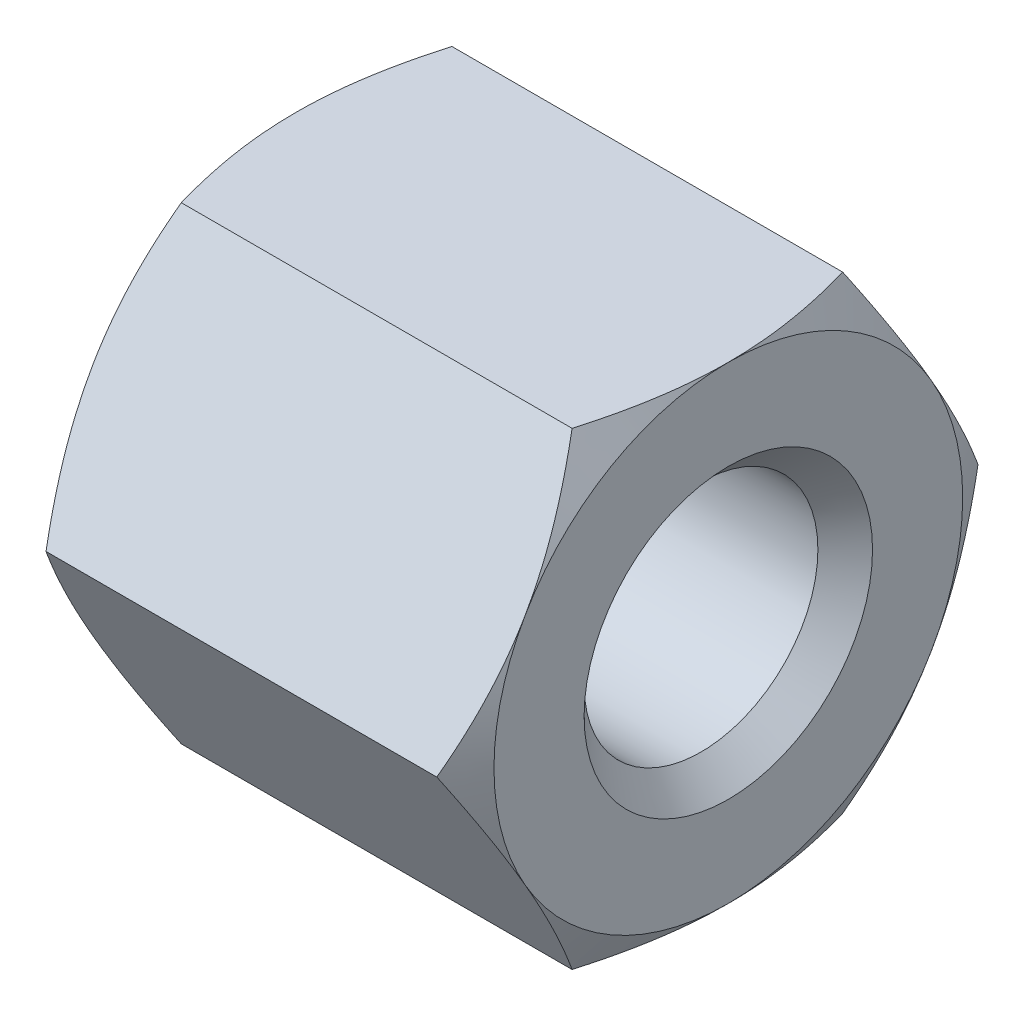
ISO-10303-21;
HEADER;
FILE_DESCRIPTION(('STEP AP214'),'2;1');
FILE_NAME('part.step','',(''),(''),'','','');
FILE_SCHEMA(('AUTOMOTIVE_DESIGN { 1 0 10303 214 1 1 1 1 }'));
ENDSEC;
DATA;
#1=APPLICATION_CONTEXT('core data for automotive mechanical design processes');
#2=APPLICATION_PROTOCOL_DEFINITION('international standard','automotive_design',2000,#1);
#3=PRODUCT_CONTEXT('',#1,'mechanical');
#4=PRODUCT('Part','Part','',(#3));
#5=PRODUCT_RELATED_PRODUCT_CATEGORY('part','',(#4));
#6=PRODUCT_DEFINITION_FORMATION('','',#4);
#7=PRODUCT_DEFINITION_CONTEXT('part definition',#1,'design');
#8=PRODUCT_DEFINITION('design','',#6,#7);
#9=PRODUCT_DEFINITION_SHAPE('','',#8);
#10=(LENGTH_UNIT() NAMED_UNIT(*) SI_UNIT(.MILLI.,.METRE.));
#11=(NAMED_UNIT(*) PLANE_ANGLE_UNIT() SI_UNIT($,.RADIAN.));
#12=(NAMED_UNIT(*) SI_UNIT($,.STERADIAN.) SOLID_ANGLE_UNIT());
#13=UNCERTAINTY_MEASURE_WITH_UNIT(LENGTH_MEASURE(1.E-05),#10,'distance_accuracy_value','');
#14=(GEOMETRIC_REPRESENTATION_CONTEXT(3) GLOBAL_UNCERTAINTY_ASSIGNED_CONTEXT((#13)) GLOBAL_UNIT_ASSIGNED_CONTEXT((#10,
#11,#12)) REPRESENTATION_CONTEXT('',''));
#15=CARTESIAN_POINT('',(0.,0.,0.));
#16=DIRECTION('',(0.,0.,1.));
#17=DIRECTION('',(1.,0.,0.));
#18=AXIS2_PLACEMENT_3D('',#15,#16,#17);
#19=CARTESIAN_POINT('',(60.,-32.5,18.7638837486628));
#20=DIRECTION('',(0.,-0.5,0.866025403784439));
#21=DIRECTION('',(-1.,0.,0.));
#22=AXIS2_PLACEMENT_3D('',#19,#20,#21);
#23=PLANE('',#22);
#24=DIRECTION('',(-1.,0.,0.));
#25=VECTOR('',#24,1.);
#26=CARTESIAN_POINT('',(60.,0.,37.5277674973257));
#27=LINE('',#26,#25);
#28=CARTESIAN_POINT('',(57.0972170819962,0.,37.5277674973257));
#29=VERTEX_POINT('',#28);
#30=CARTESIAN_POINT('',(2.90278291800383,0.,37.5277674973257));
#31=VERTEX_POINT('',#30);
#32=EDGE_CURVE('E10',#29,#31,#27,.T.);
#33=ORIENTED_EDGE('',*,*,#32,.T.);
#34=CARTESIAN_POINT('',(0.,-16.25,28.1458256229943));
#35=CARTESIAN_POINT('',(-6.06957400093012E-05,-15.7921171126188,28.4101173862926));
#36=CARTESIAN_POINT('',(0.00742678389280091,-15.3342791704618,28.6744766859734));
#37=CARTESIAN_POINT('',(0.0372859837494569,-14.4185562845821,29.2033480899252));
#38=CARTESIAN_POINT('',(0.0596727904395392,-13.9606717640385,29.4678600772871));
#39=CARTESIAN_POINT('',(0.119310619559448,-13.0426800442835,29.9982327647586));
#40=CARTESIAN_POINT('',(0.156657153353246,-12.5825777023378,30.2640910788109));
#41=CARTESIAN_POINT('',(0.245063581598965,-11.6690218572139,30.7916064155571));
#42=CARTESIAN_POINT('',(0.295945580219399,-11.2155573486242,31.0532743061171));
#43=CARTESIAN_POINT('',(0.411580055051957,-10.3080008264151,31.576984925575));
#44=CARTESIAN_POINT('',(0.476390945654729,-9.8539144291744,31.8390244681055));
#45=CARTESIAN_POINT('',(0.619817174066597,-8.94336836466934,32.3645319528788));
#46=CARTESIAN_POINT('',(0.698548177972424,-8.48692262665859,32.6279923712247));
#47=CARTESIAN_POINT('',(0.865474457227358,-7.59272925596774,33.1439569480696));
#48=CARTESIAN_POINT('',(0.95320714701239,-7.15491926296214,33.3965032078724));
#49=CARTESIAN_POINT('',(1.14062776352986,-6.27739603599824,33.9027319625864));
#50=CARTESIAN_POINT('',(1.24041091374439,-5.83769822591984,34.1564058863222));
#51=CARTESIAN_POINT('',(1.45190488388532,-4.95526511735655,34.6656637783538));
#52=CARTESIAN_POINT('',(1.56373950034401,-4.51255290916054,34.921236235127));
#53=CARTESIAN_POINT('',(1.79930885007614,-3.6229858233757,35.4349256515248));
#54=CARTESIAN_POINT('',(1.92318952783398,-3.17616091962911,35.6930274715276));
#55=CARTESIAN_POINT('',(2.18282957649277,-2.27732064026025,36.2123002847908));
#56=CARTESIAN_POINT('',(2.31875096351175,-1.82534095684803,36.4734518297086));
#57=CARTESIAN_POINT('',(2.60246507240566,-0.91519469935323,36.9992515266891));
#58=CARTESIAN_POINT('',(2.75043055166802,-0.457067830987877,37.263875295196));
#59=CARTESIAN_POINT('',(2.90278291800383,0.,37.5277674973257));
#60=B_SPLINE_CURVE_WITH_KNOTS('',3,(#34,#35,#36,#37,#38,#39,#40,#41,#42,#43,#44,#45,#46,#47,#48,
#49,#50,#51,#52,#53,#54,#55,#56,#57,#58,#59),.UNSPECIFIED.,.F.,.F.,(4,2,2,2,2,2,2,2,2,2,2,2,4),
(0.,1.58599003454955,3.17358842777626,4.77148875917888,6.349345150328,7.93395251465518,
9.53240509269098,11.0712322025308,12.6231309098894,14.192848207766,15.7847679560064,
17.4029021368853,19.0508907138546),.UNSPECIFIED.);
#61=CARTESIAN_POINT('',(0.,-16.25,28.1458256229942));
#62=VERTEX_POINT('',#61);
#63=EDGE_CURVE('E752',#62,#31,#60,.T.);
#64=ORIENTED_EDGE('',*,*,#63,.F.);
#65=CARTESIAN_POINT('',(2.9027829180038,-32.4999999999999,18.7638837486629));
#66=CARTESIAN_POINT('',(2.67537951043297,-31.8177785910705,19.1577107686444));
#67=CARTESIAN_POINT('',(2.45782768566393,-31.1330205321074,19.5529947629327));
#68=CARTESIAN_POINT('',(2.0502581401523,-29.775442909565,20.336831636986));
#69=CARTESIAN_POINT('',(1.85969459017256,-29.1027442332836,20.7253107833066));
#70=CARTESIAN_POINT('',(1.50601602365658,-27.7660418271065,21.4975626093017));
#71=CARTESIAN_POINT('',(1.34243315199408,-27.1021288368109,21.8812766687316));
#72=CARTESIAN_POINT('',(1.04273374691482,-25.7792636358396,22.6460793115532));
#73=CARTESIAN_POINT('',(0.906269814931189,-25.1203691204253,23.0271312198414));
#74=CARTESIAN_POINT('',(0.653965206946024,-23.7688684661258,23.807250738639));
#75=CARTESIAN_POINT('',(0.539311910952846,-23.0760664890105,24.2063657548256));
#76=CARTESIAN_POINT('',(0.343294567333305,-21.7002606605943,24.9988294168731));
#77=CARTESIAN_POINT('',(0.261337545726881,-21.0173218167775,25.3921429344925));
#78=CARTESIAN_POINT('',(0.130641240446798,-19.6553249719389,26.1777837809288));
#79=CARTESIAN_POINT('',(0.081630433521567,-18.9762821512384,26.5700919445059));
#80=CARTESIAN_POINT('',(0.0161173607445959,-17.6148745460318,27.3569466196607));
#81=CARTESIAN_POINT('',(-0.000275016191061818,-16.9325062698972,27.7514962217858));
#82=CARTESIAN_POINT('',(0.,-16.25,28.1458256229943));
#83=B_SPLINE_CURVE_WITH_KNOTS('',3,(#65,#66,#67,#68,#69,#70,#71,#72,#73,#74,#75,#76,#77,#78,#79,
#80,#81,#82),.UNSPECIFIED.,.F.,.F.,(4,2,2,2,2,2,2,2,4),(0.,2.45975370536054,4.8589764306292,
7.21080507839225,9.53022809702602,11.9528238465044,14.3292338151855,16.6858105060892,
19.0503129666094),.UNSPECIFIED.);
#84=CARTESIAN_POINT('',(2.90278291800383,-32.5,18.7638837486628));
#85=VERTEX_POINT('',#84);
#86=EDGE_CURVE('E748',#85,#62,#83,.T.);
#87=ORIENTED_EDGE('',*,*,#86,.F.);
#88=DIRECTION('',(-1.,0.,0.));
#89=VECTOR('',#88,1.);
#90=CARTESIAN_POINT('',(60.,-32.5,18.7638837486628));
#91=LINE('',#90,#89);
#92=CARTESIAN_POINT('',(57.0972170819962,-32.5,18.7638837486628));
#93=VERTEX_POINT('',#92);
#94=EDGE_CURVE('E298',#93,#85,#91,.T.);
#95=ORIENTED_EDGE('',*,*,#94,.F.);
#96=CARTESIAN_POINT('',(60.,-16.25,28.1458256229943));
#97=CARTESIAN_POINT('',(60.0000606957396,-16.7078248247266,27.881433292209));
#98=CARTESIAN_POINT('',(59.9925732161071,-17.1656856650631,27.6171136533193));
#99=CARTESIAN_POINT('',(59.9627140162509,-18.0815631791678,27.0885100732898));
#100=CARTESIAN_POINT('',(59.9403272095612,-18.5395795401,26.8242264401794));
#101=CARTESIAN_POINT('',(59.8806893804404,-19.4578916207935,26.2944086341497));
#102=CARTESIAN_POINT('',(59.8433428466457,-19.9181828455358,26.0288774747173));
#103=CARTESIAN_POINT('',(59.754936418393,-20.8318024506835,25.5014725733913));
#104=CARTESIAN_POINT('',(59.7040544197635,-21.2851457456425,25.2395947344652));
#105=CARTESIAN_POINT('',(59.5884199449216,-22.1924707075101,24.7154830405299));
#106=CARTESIAN_POINT('',(59.523609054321,-22.6464468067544,24.4532524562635));
#107=CARTESIAN_POINT('',(59.3801828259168,-23.5568226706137,23.9274501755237));
#108=CARTESIAN_POINT('',(59.301451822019,-24.0132089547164,23.6638867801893));
#109=CARTESIAN_POINT('',(59.1345255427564,-24.9071440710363,23.1474748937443));
#110=CARTESIAN_POINT('',(59.0467928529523,-25.3447605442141,22.8945934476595));
#111=CARTESIAN_POINT('',(58.8593722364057,-26.2219291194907,22.3877504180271));
#112=CARTESIAN_POINT('',(58.7595890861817,-26.6614660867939,22.1337979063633));
#113=CARTESIAN_POINT('',(58.5480951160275,-27.5437129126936,21.6242173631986));
#114=CARTESIAN_POINT('',(58.4362604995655,-27.9864012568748,21.368603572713));
#115=CARTESIAN_POINT('',(58.2006911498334,-28.8760528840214,20.8550605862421));
#116=CARTESIAN_POINT('',(58.0768104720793,-29.3229880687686,20.5971497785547));
#117=CARTESIAN_POINT('',(57.8171704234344,-30.2221116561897,20.0783676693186));
#118=CARTESIAN_POINT('',(57.6812490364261,-30.6742653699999,19.8175175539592));
#119=CARTESIAN_POINT('',(57.3975349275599,-31.5846943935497,19.2922076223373));
#120=CARTESIAN_POINT('',(57.2495694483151,-32.0429287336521,19.0277700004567));
#121=CARTESIAN_POINT('',(57.0972170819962,-32.5,18.7638837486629));
#122=B_SPLINE_CURVE_WITH_KNOTS('',3,(#96,#97,#98,#99,#100,#101,#102,#103,#104,#105,#106,#107,
#108,#109,#110,#111,#112,#113,#114,#115,#116,#117,#118,#119,#120,#121),.UNSPECIFIED.,.F.,.F.,(4,
2,2,2,2,2,2,2,2,2,2,2,4),(0.,1.58599003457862,3.17358842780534,4.77148875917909,6.3493451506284,
7.93395251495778,9.53240509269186,11.0712322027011,12.6231309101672,14.1928482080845,
15.7847679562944,17.4029021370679,19.0508907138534),.UNSPECIFIED.);
#123=CARTESIAN_POINT('',(60.,-16.25,28.1458256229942));
#124=VERTEX_POINT('',#123);
#125=EDGE_CURVE('E284',#124,#93,#122,.T.);
#126=ORIENTED_EDGE('',*,*,#125,.F.);
#127=CARTESIAN_POINT('',(57.0972170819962,1.57465114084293E-13,37.5277674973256));
#128=CARTESIAN_POINT('',(57.3246204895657,-0.682174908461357,37.1338599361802));
#129=CARTESIAN_POINT('',(57.5421723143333,-1.36687991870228,36.7384840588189));
#130=CARTESIAN_POINT('',(57.9497418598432,-2.72449137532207,35.9547057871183));
#131=CARTESIAN_POINT('',(58.1403054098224,-3.39727352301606,35.5663712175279));
#132=CARTESIAN_POINT('',(58.4939839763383,-4.734414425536,34.794878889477));
#133=CARTESIAN_POINT('',(58.6575668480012,-5.39867704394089,34.4117704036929));
#134=CARTESIAN_POINT('',(58.9572662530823,-6.72244816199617,33.6485368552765));
#135=CARTESIAN_POINT('',(59.0937301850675,-7.3818960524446,33.2684434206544));
#136=CARTESIAN_POINT('',(59.3460347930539,-8.7332497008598,32.4880692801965));
#137=CARTESIAN_POINT('',(59.4606880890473,-9.42529443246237,32.0876426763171));
#138=CARTESIAN_POINT('',(59.6567054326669,-10.799491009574,31.2923917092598));
#139=CARTESIAN_POINT('',(59.7386624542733,-11.4815799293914,30.8976060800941));
#140=CARTESIAN_POINT('',(59.8693587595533,-12.8429632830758,30.1109026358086));
#141=CARTESIAN_POINT('',(59.9183695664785,-13.5222335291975,29.7189883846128));
#142=CARTESIAN_POINT('',(59.9838826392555,-14.884373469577,28.9334021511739));
#143=CARTESIAN_POINT('',(60.0002750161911,-15.5672475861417,28.5397286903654));
#144=CARTESIAN_POINT('',(60.,-16.25,28.1458256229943));
#145=B_SPLINE_CURVE_WITH_KNOTS('',3,(#127,#128,#129,#130,#131,#132,#133,#134,#135,#136,#137,
#138,#139,#140,#141,#142,#143,#144),.UNSPECIFIED.,.F.,.F.,(4,2,2,2,2,2,2,2,4),(0.,
2.45975370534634,4.85897643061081,7.21080507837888,9.5302280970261,11.9528238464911,
14.3292338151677,16.6858105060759,19.0503129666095),.UNSPECIFIED.);
#146=EDGE_CURVE('E294',#29,#124,#145,.T.);
#147=ORIENTED_EDGE('',*,*,#146,.F.);
#148=EDGE_LOOP('',(#33,#64,#87,#95,#126,#147));
#149=FACE_BOUND('',#148,.T.);
#150=ADVANCED_FACE('F16',(#149),#23,.T.);
#151=CARTESIAN_POINT('',(60.,0.,37.5277674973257));
#152=DIRECTION('',(0.,0.5,0.866025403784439));
#153=DIRECTION('',(1.,0.,0.));
#154=AXIS2_PLACEMENT_3D('',#151,#152,#153);
#155=PLANE('',#154);
#156=DIRECTION('',(-1.,0.,0.));
#157=VECTOR('',#156,1.);
#158=CARTESIAN_POINT('',(60.,32.5,18.7638837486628));
#159=LINE('',#158,#157);
#160=CARTESIAN_POINT('',(57.0972170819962,32.5,18.7638837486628));
#161=VERTEX_POINT('',#160);
#162=CARTESIAN_POINT('',(2.90278291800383,32.5,18.7638837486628));
#163=VERTEX_POINT('',#162);
#164=EDGE_CURVE('E30',#161,#163,#159,.T.);
#165=ORIENTED_EDGE('',*,*,#164,.T.);
#166=CARTESIAN_POINT('',(0.,16.25,28.1458256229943));
#167=CARTESIAN_POINT('',(-6.06957393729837E-05,16.7078248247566,27.8814332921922));
#168=CARTESIAN_POINT('',(0.00742678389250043,17.1656856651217,27.6171136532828));
#169=CARTESIAN_POINT('',(0.0372859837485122,18.0815631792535,27.0885100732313));
#170=CARTESIAN_POINT('',(0.0596727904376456,18.5395795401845,26.8242264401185));
#171=CARTESIAN_POINT('',(0.119310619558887,19.4578916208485,26.2944086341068));
#172=CARTESIAN_POINT('',(0.156657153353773,19.9181828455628,26.0288774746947));
#173=CARTESIAN_POINT('',(0.245063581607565,20.8318024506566,25.5014725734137));
#174=CARTESIAN_POINT('',(0.295945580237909,21.2851457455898,25.2395947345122));
#175=CARTESIAN_POINT('',(0.411580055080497,22.1924707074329,24.7154830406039));
#176=CARTESIAN_POINT('',(0.476390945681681,22.6464468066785,24.4532524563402));
#177=CARTESIAN_POINT('',(0.619817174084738,23.5568226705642,23.927450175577));
#178=CARTESIAN_POINT('',(0.698548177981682,24.0132089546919,23.6638867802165));
#179=CARTESIAN_POINT('',(0.865474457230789,24.9071440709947,23.1474748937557));
#180=CARTESIAN_POINT('',(0.953207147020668,25.3447605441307,22.8945934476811));
#181=CARTESIAN_POINT('',(1.14062776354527,26.2219291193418,22.3877504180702));
#182=CARTESIAN_POINT('',(1.24041091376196,26.6614660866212,22.133797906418));
#183=CARTESIAN_POINT('',(1.45190488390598,27.5437129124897,21.6242173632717));
#184=CARTESIAN_POINT('',(1.56373950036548,27.9864012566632,21.3686035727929));
#185=CARTESIAN_POINT('',(1.79930885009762,28.876052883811,20.8550605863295));
#186=CARTESIAN_POINT('',(1.92318952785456,29.322988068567,20.5971497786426));
#187=CARTESIAN_POINT('',(2.18282957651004,30.2221116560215,20.0783676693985));
#188=CARTESIAN_POINT('',(2.3187509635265,30.6742653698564,19.8175175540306));
#189=CARTESIAN_POINT('',(2.60246507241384,31.5846943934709,19.29220762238));
#190=CARTESIAN_POINT('',(2.75043055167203,32.0429287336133,19.0277700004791));
#191=CARTESIAN_POINT('',(2.90278291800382,32.5,18.7638837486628));
#192=B_SPLINE_CURVE_WITH_KNOTS('',3,(#166,#167,#168,#169,#170,#171,#172,#173,#174,#175,#176,
#177,#178,#179,#180,#181,#182,#183,#184,#185,#186,#187,#188,#189,#190,#191),.UNSPECIFIED.,.F.,
.F.,(4,2,2,2,2,2,2,2,2,2,2,2,4),(0.,1.58599003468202,3.17358842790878,4.77148875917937,
6.34934515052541,7.93395251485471,9.53240509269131,11.0712322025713,12.6231309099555,
14.1928482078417,15.7847679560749,17.4029021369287,19.0508907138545),.UNSPECIFIED.);
#193=CARTESIAN_POINT('',(0.,16.25,28.1458256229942));
#194=VERTEX_POINT('',#193);
#195=EDGE_CURVE('E149',#194,#163,#192,.T.);
#196=ORIENTED_EDGE('',*,*,#195,.F.);
#197=CARTESIAN_POINT('',(2.90278291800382,0.,37.5277674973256));
#198=CARTESIAN_POINT('',(2.67537951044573,0.682174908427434,37.1338599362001));
#199=CARTESIAN_POINT('',(2.45782768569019,1.36687991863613,36.7384840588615));
#200=CARTESIAN_POINT('',(2.05025814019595,2.72449137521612,35.9547057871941));
#201=CARTESIAN_POINT('',(1.85969459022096,3.39727352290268,35.566371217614));
#202=CARTESIAN_POINT('',(1.50601602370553,4.73441442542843,34.7948788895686));
#203=CARTESIAN_POINT('',(1.34243315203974,5.39867704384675,34.4117704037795));
#204=CARTESIAN_POINT('',(1.04273374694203,6.72244816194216,33.648536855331));
#205=CARTESIAN_POINT('',(0.906269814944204,7.38189605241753,33.2684434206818));
#206=CARTESIAN_POINT('',(0.653965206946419,8.73324970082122,32.4880692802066));
#207=CARTESIAN_POINT('',(0.539311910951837,9.42529443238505,32.0876426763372));
#208=CARTESIAN_POINT('',(0.343294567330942,10.7994910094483,31.292391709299));
#209=CARTESIAN_POINT('',(0.261337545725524,11.4815799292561,30.8976060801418));
#210=CARTESIAN_POINT('',(0.130641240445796,12.8429632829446,30.1109026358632));
#211=CARTESIAN_POINT('',(0.0816304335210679,13.5222335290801,29.7189883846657));
#212=CARTESIAN_POINT('',(0.0161173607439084,14.8843734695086,28.933402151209));
#213=CARTESIAN_POINT('',(-0.000275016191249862,15.5672475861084,28.5397286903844));
#214=CARTESIAN_POINT('',(0.,16.25,28.1458256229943));
#215=B_SPLINE_CURVE_WITH_KNOTS('',3,(#197,#198,#199,#200,#201,#202,#203,#204,#205,#206,#207,
#208,#209,#210,#211,#212,#213,#214),.UNSPECIFIED.,.F.,.F.,(4,2,2,2,2,2,2,2,4),(0.,
2.45975370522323,4.85897643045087,7.21080507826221,9.53022809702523,11.9528238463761,
14.3292338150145,16.685810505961,19.0503129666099),.UNSPECIFIED.);
#216=EDGE_CURVE('E742',#31,#194,#215,.T.);
#217=ORIENTED_EDGE('',*,*,#216,.F.);
#218=ORIENTED_EDGE('',*,*,#32,.F.);
#219=CARTESIAN_POINT('',(60.,16.25,28.1458256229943));
#220=CARTESIAN_POINT('',(60.0000606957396,15.79211711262,28.4101173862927));
#221=CARTESIAN_POINT('',(59.992573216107,15.3342791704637,28.6744766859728));
#222=CARTESIAN_POINT('',(59.9627140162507,14.4185562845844,29.2033480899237));
#223=CARTESIAN_POINT('',(59.9403272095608,13.9606717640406,29.4678600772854));
#224=CARTESIAN_POINT('',(59.8806893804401,13.0426800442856,29.9982327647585));
#225=CARTESIAN_POINT('',(59.8433428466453,12.58257770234,30.2640910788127));
#226=CARTESIAN_POINT('',(59.754936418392,11.6690218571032,30.7916064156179));
#227=CARTESIAN_POINT('',(59.7040544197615,11.2155573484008,31.053274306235));
#228=CARTESIAN_POINT('',(59.5884199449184,10.3080008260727,31.5769849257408));
#229=CARTESIAN_POINT('',(59.5236090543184,9.85391442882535,31.8390244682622));
#230=CARTESIAN_POINT('',(59.380182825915,8.94336836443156,32.3645319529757));
#231=CARTESIAN_POINT('',(59.301451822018,8.48692262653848,32.6279923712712));
#232=CARTESIAN_POINT('',(59.1345255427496,7.59272925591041,33.1439569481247));
#233=CARTESIAN_POINT('',(59.0467928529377,7.1549192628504,33.3965032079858));
#234=CARTESIAN_POINT('',(58.8593722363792,6.27739603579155,33.9027319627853));
#235=CARTESIAN_POINT('',(58.7595890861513,5.83769822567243,34.1564058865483));
#236=CARTESIAN_POINT('',(58.5480951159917,4.95526511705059,34.665663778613));
#237=CARTESIAN_POINT('',(58.4362604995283,4.51255290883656,34.9212362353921));
#238=CARTESIAN_POINT('',(58.2006911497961,3.62298582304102,35.4349256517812));
#239=CARTESIAN_POINT('',(58.0768104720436,3.17616091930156,35.6930274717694));
#240=CARTESIAN_POINT('',(57.8171704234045,2.27732063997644,36.2123002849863));
#241=CARTESIAN_POINT('',(57.6812490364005,1.82534095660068,36.4734518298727));
#242=CARTESIAN_POINT('',(57.3975349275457,0.915194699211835,36.999251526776));
#243=CARTESIAN_POINT('',(57.2495694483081,0.457067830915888,37.2638752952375));
#244=CARTESIAN_POINT('',(57.0972170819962,0.,37.5277674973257));
#245=B_SPLINE_CURVE_WITH_KNOTS('',3,(#219,#220,#221,#222,#223,#224,#225,#226,#227,#228,#229,
#230,#231,#232,#233,#234,#235,#236,#237,#238,#239,#240,#241,#242,#243,#244),.UNSPECIFIED.,.F.,
.F.,(4,2,2,2,2,2,2,2,2,2,2,2,4),(0.,1.5859900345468,3.17358842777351,4.77148875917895,
6.34934515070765,7.93395251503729,9.53240509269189,11.071232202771,12.6231309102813,
14.1928482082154,15.7847679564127,17.4029021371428,19.0508907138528),.UNSPECIFIED.);
#246=CARTESIAN_POINT('',(60.,16.25,28.1458256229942));
#247=VERTEX_POINT('',#246);
#248=EDGE_CURVE('E329',#247,#29,#245,.T.);
#249=ORIENTED_EDGE('',*,*,#248,.F.);
#250=CARTESIAN_POINT('',(57.0972170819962,32.5,18.7638837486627));
#251=CARTESIAN_POINT('',(57.3246204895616,31.8177785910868,19.157710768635));
#252=CARTESIAN_POINT('',(57.5421723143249,31.1330205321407,19.5529947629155));
#253=CARTESIAN_POINT('',(57.9497418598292,29.7754429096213,20.3368316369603));
#254=CARTESIAN_POINT('',(58.1403054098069,29.1027442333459,20.7253107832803));
#255=CARTESIAN_POINT('',(58.4939839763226,27.7660418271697,21.4975626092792));
#256=CARTESIAN_POINT('',(58.6575668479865,27.1021288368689,21.8812766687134));
#257=CARTESIAN_POINT('',(58.9572662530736,25.7792636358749,22.6460793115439));
#258=CARTESIAN_POINT('',(59.0937301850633,25.1203691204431,23.0271312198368));
#259=CARTESIAN_POINT('',(59.3460347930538,23.7688684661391,23.8072507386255));
#260=CARTESIAN_POINT('',(59.4606880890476,23.0760664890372,24.2063657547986));
#261=CARTESIAN_POINT('',(59.6567054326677,21.7002606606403,24.9988294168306));
#262=CARTESIAN_POINT('',(59.7386624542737,21.0173218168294,25.3921429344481));
#263=CARTESIAN_POINT('',(59.8693587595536,19.6553249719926,26.1777837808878));
#264=CARTESIAN_POINT('',(59.9183695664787,18.9762821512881,26.5700919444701));
#265=CARTESIAN_POINT('',(59.9838826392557,17.6148745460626,27.3569466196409));
#266=CARTESIAN_POINT('',(60.0002750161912,16.932506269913,27.7514962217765));
#267=CARTESIAN_POINT('',(60.,16.25,28.1458256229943));
#268=B_SPLINE_CURVE_WITH_KNOTS('',3,(#250,#251,#252,#253,#254,#255,#256,#257,#258,#259,#260,
#261,#262,#263,#264,#265,#266,#267),.UNSPECIFIED.,.F.,.F.,(4,2,2,2,2,2,2,2,4),(0.,
2.45975370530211,4.85897643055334,7.21080507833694,9.53022809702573,11.9528238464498,
14.3292338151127,16.6858105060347,19.0503129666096),.UNSPECIFIED.);
#269=EDGE_CURVE('E152',#161,#247,#268,.T.);
#270=ORIENTED_EDGE('',*,*,#269,.F.);
#271=EDGE_LOOP('',(#165,#196,#217,#218,#249,#270));
#272=FACE_BOUND('',#271,.T.);
#273=ADVANCED_FACE('F146',(#272),#155,.T.);
#274=CARTESIAN_POINT('',(60.,32.5,18.7638837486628));
#275=DIRECTION('',(0.,1.,0.));
#276=DIRECTION('',(1.,0.,0.));
#277=AXIS2_PLACEMENT_3D('',#274,#275,#276);
#278=PLANE('',#277);
#279=DIRECTION('',(-1.,0.,0.));
#280=VECTOR('',#279,1.);
#281=CARTESIAN_POINT('',(60.,32.5,-18.7638837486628));
#282=LINE('',#281,#280);
#283=CARTESIAN_POINT('',(57.0972170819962,32.5,-18.7638837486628));
#284=VERTEX_POINT('',#283);
#285=CARTESIAN_POINT('',(2.90278291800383,32.5,-18.7638837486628));
#286=VERTEX_POINT('',#285);
#287=EDGE_CURVE('E157',#284,#286,#282,.T.);
#288=ORIENTED_EDGE('',*,*,#287,.T.);
#289=CARTESIAN_POINT('',(0.,32.5,0.));
#290=CARTESIAN_POINT('',(-0.000277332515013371,32.4997520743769,-0.790161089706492));
#291=CARTESIAN_POINT('',(0.0161940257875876,32.4992403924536,-1.58031267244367));
#292=CARTESIAN_POINT('',(0.0820217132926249,32.4984948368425,-3.1565948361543));
#293=CARTESIAN_POINT('',(0.131267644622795,32.4982600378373,-3.94273001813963));
#294=CARTESIAN_POINT('',(0.262591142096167,32.4988637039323,-5.51893950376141));
#295=CARTESIAN_POINT('',(0.344943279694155,32.4997112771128,-6.30899076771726));
#296=CARTESIAN_POINT('',(0.541898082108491,32.5012991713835,-7.90070251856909));
#297=CARTESIAN_POINT('',(0.657099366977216,32.5020370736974,-8.70228827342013));
#298=CARTESIAN_POINT('',(0.909961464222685,32.5021495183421,-10.262781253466));
#299=CARTESIAN_POINT('',(1.04629367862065,32.5015872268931,-11.0219052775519));
#300=CARTESIAN_POINT('',(1.34560934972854,32.5006902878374,-12.5459607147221));
#301=CARTESIAN_POINT('',(1.50894067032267,32.5003589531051,-13.3108236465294));
#302=CARTESIAN_POINT('',(1.86199294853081,32.4999581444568,-14.8506792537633));
#303=CARTESIAN_POINT('',(2.0521805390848,32.4998940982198,-15.6255642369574));
#304=CARTESIAN_POINT('',(2.45887770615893,32.4998902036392,-17.1893245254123));
#305=CARTESIAN_POINT('',(2.67593080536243,32.4999535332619,-17.9780588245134));
#306=CARTESIAN_POINT('',(2.90278291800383,32.5,-18.7638837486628));
#307=B_SPLINE_CURVE_WITH_KNOTS('',3,(#289,#290,#291,#292,#293,#294,#295,#296,#297,#298,#299,
#300,#301,#302,#303,#304,#305,#306),.UNSPECIFIED.,.F.,.F.,(4,2,2,2,2,2,2,2,4),(0.,
2.37028686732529,4.73262979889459,7.11498328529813,9.54387874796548,11.8572673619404,
14.2031921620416,16.5965292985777,19.0503195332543),.UNSPECIFIED.);
#308=CARTESIAN_POINT('',(0.,32.5,0.));
#309=VERTEX_POINT('',#308);
#310=EDGE_CURVE('E165',#309,#286,#307,.T.);
#311=ORIENTED_EDGE('',*,*,#310,.F.);
#312=CARTESIAN_POINT('',(2.90278291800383,32.5,18.7638837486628));
#313=CARTESIAN_POINT('',(2.67588684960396,32.4999542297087,17.9779049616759));
#314=CARTESIAN_POINT('',(2.45878966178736,32.4998834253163,17.1890166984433));
#315=CARTESIAN_POINT('',(2.05201433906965,32.4998618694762,15.624972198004));
#316=CARTESIAN_POINT('',(1.86179202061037,32.4999082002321,14.8499571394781));
#317=CARTESIAN_POINT('',(1.50868114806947,32.5002687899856,13.309862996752));
#318=CARTESIAN_POINT('',(1.34532524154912,32.500577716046,12.5448917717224));
#319=CARTESIAN_POINT('',(1.04596678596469,32.501420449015,11.0206398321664));
#320=CARTESIAN_POINT('',(0.909615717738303,32.5019510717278,10.2614277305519));
#321=CARTESIAN_POINT('',(0.656798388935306,32.5017993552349,8.70113644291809));
#322=CARTESIAN_POINT('',(0.54164796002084,32.5010557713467,7.89984254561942));
#323=CARTESIAN_POINT('',(0.344779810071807,32.4994954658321,6.3085968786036));
#324=CARTESIAN_POINT('',(0.262467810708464,32.4986804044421,5.5187192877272));
#325=CARTESIAN_POINT('',(0.131204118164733,32.4981461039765,3.94274524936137));
#326=CARTESIAN_POINT('',(0.0819825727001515,32.4984178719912,3.15667143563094));
#327=CARTESIAN_POINT('',(0.0161843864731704,32.4992203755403,1.58040459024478));
#328=CARTESIAN_POINT('',(-0.000277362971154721,32.499752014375,0.790206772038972));
#329=CARTESIAN_POINT('',(0.,32.5,0.));
#330=B_SPLINE_CURVE_WITH_KNOTS('',3,(#312,#313,#314,#315,#316,#317,#318,#319,#320,#321,#322,
#323,#324,#325,#326,#327,#328,#329),.UNSPECIFIED.,.F.,.F.,(4,2,2,2,2,2,2,2,4),(0.,
2.45427052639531,4.84801141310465,7.194269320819,9.50792766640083,11.935934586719,
14.3177570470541,16.6799121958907,19.0503371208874),.UNSPECIFIED.);
#331=EDGE_CURVE('E161',#163,#309,#330,.T.);
#332=ORIENTED_EDGE('',*,*,#331,.F.);
#333=ORIENTED_EDGE('',*,*,#164,.F.);
#334=CARTESIAN_POINT('',(60.,32.5,0.));
#335=CARTESIAN_POINT('',(60.000277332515,32.499752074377,0.790161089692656));
#336=CARTESIAN_POINT('',(59.9838059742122,32.499240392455,1.58031267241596));
#337=CARTESIAN_POINT('',(59.9179782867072,32.4984948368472,3.15659483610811));
#338=CARTESIAN_POINT('',(59.8687323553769,32.4982600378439,3.94273001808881));
#339=CARTESIAN_POINT('',(59.7374088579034,32.4988637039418,5.51893950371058));
#340=CARTESIAN_POINT('',(59.6550567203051,32.4997112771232,6.30899076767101));
#341=CARTESIAN_POINT('',(59.4581019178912,32.5012991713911,7.90070251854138));
#342=CARTESIAN_POINT('',(59.3429006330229,32.5020370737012,8.70228827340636));
#343=CARTESIAN_POINT('',(59.0900385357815,32.5021495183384,10.2627812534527));
#344=CARTESIAN_POINT('',(58.9537063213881,32.5015872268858,11.0219052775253));
#345=CARTESIAN_POINT('',(58.6543906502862,32.5006902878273,12.5459607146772));
#346=CARTESIAN_POINT('',(58.4910593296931,32.500358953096,13.3108236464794));
#347=CARTESIAN_POINT('',(58.1380070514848,32.4999581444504,14.8506792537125));
#348=CARTESIAN_POINT('',(57.9478194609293,32.4998940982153,15.6255642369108));
#349=CARTESIAN_POINT('',(57.5411222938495,32.4998902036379,17.1893245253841));
#350=CARTESIAN_POINT('',(57.3240691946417,32.4999535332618,17.9780588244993));
#351=CARTESIAN_POINT('',(57.0972170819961,32.5,18.7638837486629));
#352=B_SPLINE_CURVE_WITH_KNOTS('',3,(#334,#335,#336,#337,#338,#339,#340,#341,#342,#343,#344,
#345,#346,#347,#348,#349,#350,#351),.UNSPECIFIED.,.F.,.F.,(4,2,2,2,2,2,2,2,4),(0.,
2.37028686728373,4.73262979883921,7.11498328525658,9.54387874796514,11.8572673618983,
14.2031921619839,16.5965292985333,19.0503195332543),.UNSPECIFIED.);
#353=CARTESIAN_POINT('',(60.,32.5,0.));
#354=VERTEX_POINT('',#353);
#355=EDGE_CURVE('E377',#354,#161,#352,.T.);
#356=ORIENTED_EDGE('',*,*,#355,.F.);
#357=CARTESIAN_POINT('',(57.0972170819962,32.5,-18.7638837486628));
#358=CARTESIAN_POINT('',(57.3241131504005,32.4999542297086,-17.9779049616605));
#359=CARTESIAN_POINT('',(57.5412103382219,32.4998834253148,-17.1890166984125));
#360=CARTESIAN_POINT('',(57.9479856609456,32.4998618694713,-15.6249721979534));
#361=CARTESIAN_POINT('',(58.1382079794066,32.4999082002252,-14.8499571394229));
#362=CARTESIAN_POINT('',(58.4913188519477,32.5002687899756,-13.3098629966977));
#363=CARTESIAN_POINT('',(58.6546747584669,32.5005777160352,-12.5448917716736));
#364=CARTESIAN_POINT('',(58.9540332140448,32.5014204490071,-11.0206398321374));
#365=CARTESIAN_POINT('',(59.0903842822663,32.5019510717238,-10.2614277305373));
#366=CARTESIAN_POINT('',(59.3432016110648,32.501799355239,-8.70113644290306));
#367=CARTESIAN_POINT('',(59.4583520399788,32.501055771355,-7.89984254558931));
#368=CARTESIAN_POINT('',(59.6552201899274,32.4994954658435,-6.30859687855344));
#369=CARTESIAN_POINT('',(59.7375321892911,32.4986804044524,-5.5187192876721));
#370=CARTESIAN_POINT('',(59.8687958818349,32.4981461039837,-3.94274524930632));
#371=CARTESIAN_POINT('',(59.9180174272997,32.4984178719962,-3.1566714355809));
#372=CARTESIAN_POINT('',(59.9838156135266,32.4992203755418,-1.58040459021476));
#373=CARTESIAN_POINT('',(60.0002773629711,32.4997520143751,-0.790206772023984));
#374=CARTESIAN_POINT('',(60.,32.5,0.));
#375=B_SPLINE_CURVE_WITH_KNOTS('',3,(#357,#358,#359,#360,#361,#362,#363,#364,#365,#366,#367,
#368,#369,#370,#371,#372,#373,#374),.UNSPECIFIED.,.F.,.F.,(4,2,2,2,2,2,2,2,4),(0.,
2.45427052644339,4.84801141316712,7.19426932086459,9.50792766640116,11.9359345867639,
14.3177570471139,16.6799121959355,19.0503371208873),.UNSPECIFIED.);
#376=EDGE_CURVE('E391',#284,#354,#375,.T.);
#377=ORIENTED_EDGE('',*,*,#376,.F.);
#378=EDGE_LOOP('',(#288,#311,#332,#333,#356,#377));
#379=FACE_BOUND('',#378,.T.);
#380=ADVANCED_FACE('F163',(#379),#278,.T.);
#381=CARTESIAN_POINT('',(60.,32.5,-18.7638837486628));
#382=DIRECTION('',(0.,0.5,-0.866025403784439));
#383=DIRECTION('',(-1.,0.,0.));
#384=AXIS2_PLACEMENT_3D('',#381,#382,#383);
#385=PLANE('',#384);
#386=DIRECTION('',(-1.,0.,0.));
#387=VECTOR('',#386,1.);
#388=CARTESIAN_POINT('',(60.,0.,-37.5277674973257));
#389=LINE('',#388,#387);
#390=CARTESIAN_POINT('',(57.0972170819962,0.,-37.5277674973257));
#391=VERTEX_POINT('',#390);
#392=CARTESIAN_POINT('',(2.90278291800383,0.,-37.5277674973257));
#393=VERTEX_POINT('',#392);
#394=EDGE_CURVE('E561',#391,#393,#389,.T.);
#395=ORIENTED_EDGE('',*,*,#394,.T.);
#396=CARTESIAN_POINT('',(0.,16.25,-28.1458256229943));
#397=CARTESIAN_POINT('',(-6.06957398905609E-05,15.7921171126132,-28.4101173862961));
#398=CARTESIAN_POINT('',(0.00742678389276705,15.3342791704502,-28.6744766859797));
#399=CARTESIAN_POINT('',(0.0372859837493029,14.4185562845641,-29.2033480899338));
#400=CARTESIAN_POINT('',(0.0596727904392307,13.9606717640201,-29.4678600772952));
#401=CARTESIAN_POINT('',(0.119310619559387,13.0426800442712,-29.9982327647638));
#402=CARTESIAN_POINT('',(0.156657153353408,12.5825777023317,-30.2640910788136));
#403=CARTESIAN_POINT('',(0.245063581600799,11.6690218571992,-30.7916064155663));
#404=CARTESIAN_POINT('',(0.295945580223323,11.2155573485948,-31.0532743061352));
#405=CARTESIAN_POINT('',(0.411580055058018,10.30800082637,-31.5769849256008));
#406=CARTESIAN_POINT('',(0.476390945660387,9.85391442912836,-31.83902446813));
#407=CARTESIAN_POINT('',(0.619817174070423,8.94336836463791,-32.3645319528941));
#408=CARTESIAN_POINT('',(0.698548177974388,8.48692262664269,-32.6279923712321));
#409=CARTESIAN_POINT('',(0.865474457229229,7.5927292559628,-33.1439569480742));
#410=CARTESIAN_POINT('',(0.953207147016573,7.15491926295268,-33.3965032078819));
#411=CARTESIAN_POINT('',(1.14062776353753,6.27739603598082,-33.9027319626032));
#412=CARTESIAN_POINT('',(1.24041091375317,5.83769822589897,-34.1564058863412));
#413=CARTESIAN_POINT('',(1.45190488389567,4.95526511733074,-34.6656637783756));
#414=CARTESIAN_POINT('',(1.56373950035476,4.51255290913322,-34.9212362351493));
#415=CARTESIAN_POINT('',(1.79930885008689,3.62298582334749,-35.4349256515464));
#416=CARTESIAN_POINT('',(1.92318952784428,3.17616091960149,-35.693027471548));
#417=CARTESIAN_POINT('',(2.18282957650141,2.27732064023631,-36.2123002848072));
#418=CARTESIAN_POINT('',(2.31875096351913,1.82534095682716,-36.4734518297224));
#419=CARTESIAN_POINT('',(2.60246507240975,0.915194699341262,-36.9992515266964));
#420=CARTESIAN_POINT('',(2.75043055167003,0.457067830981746,-37.2638752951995));
#421=CARTESIAN_POINT('',(2.90278291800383,0.,-37.5277674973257));
#422=B_SPLINE_CURVE_WITH_KNOTS('',3,(#396,#397,#398,#399,#400,#401,#402,#403,#404,#405,#406,
#407,#408,#409,#410,#411,#412,#413,#414,#415,#416,#417,#418,#419,#420,#421),.UNSPECIFIED.,.F.,
.F.,(4,2,2,2,2,2,2,2,2,2,2,2,4),(0.,1.5859900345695,3.1735884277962,4.77148875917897,
6.34934515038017,7.93395251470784,9.53240509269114,11.0712322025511,12.6231309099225,
14.1928482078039,15.7847679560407,17.402902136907,19.0508907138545),.UNSPECIFIED.);
#423=CARTESIAN_POINT('',(0.,16.25,-28.1458256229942));
#424=VERTEX_POINT('',#423);
#425=EDGE_CURVE('E490',#424,#393,#422,.T.);
#426=ORIENTED_EDGE('',*,*,#425,.F.);
#427=CARTESIAN_POINT('',(2.9027829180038,32.5,-18.7638837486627));
#428=CARTESIAN_POINT('',(2.67537951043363,31.8177785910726,-19.1577107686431));
#429=CARTESIAN_POINT('',(2.45782768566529,31.1330205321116,-19.5529947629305));
#430=CARTESIAN_POINT('',(2.05025814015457,29.7754429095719,-20.3368316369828));
#431=CARTESIAN_POINT('',(1.85969459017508,29.1027442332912,-20.7253107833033));
#432=CARTESIAN_POINT('',(1.50601602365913,27.7660418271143,-21.4975626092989));
#433=CARTESIAN_POINT('',(1.34243315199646,27.102128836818,-21.8812766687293));
#434=CARTESIAN_POINT('',(1.04273374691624,25.7792636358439,-22.646079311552));
#435=CARTESIAN_POINT('',(0.906269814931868,25.1203691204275,-23.0271312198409));
#436=CARTESIAN_POINT('',(0.653965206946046,23.7688684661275,-23.8072507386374));
#437=CARTESIAN_POINT('',(0.539311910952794,23.0760664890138,-24.2063657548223));
#438=CARTESIAN_POINT('',(0.343294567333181,21.7002606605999,-24.9988294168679));
#439=CARTESIAN_POINT('',(0.26133754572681,21.0173218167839,-25.392142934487));
#440=CARTESIAN_POINT('',(0.130641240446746,19.6553249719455,-26.1777837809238));
#441=CARTESIAN_POINT('',(0.0816304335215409,18.9762821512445,-26.5700919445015));
#442=CARTESIAN_POINT('',(0.0161173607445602,17.6148745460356,-27.3569466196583));
#443=CARTESIAN_POINT('',(-0.000275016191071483,16.9325062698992,-27.7514962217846));
#444=CARTESIAN_POINT('',(0.,16.25,-28.1458256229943));
#445=B_SPLINE_CURVE_WITH_KNOTS('',3,(#427,#428,#429,#430,#431,#432,#433,#434,#435,#436,#437,
#438,#439,#440,#441,#442,#443,#444),.UNSPECIFIED.,.F.,.F.,(4,2,2,2,2,2,2,2,4),(0.,
2.45975370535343,4.85897643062,7.21080507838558,9.53022809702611,11.9528238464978,
14.3292338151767,16.6858105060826,19.0503129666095),.UNSPECIFIED.);
#446=EDGE_CURVE('E542',#286,#424,#445,.T.);
#447=ORIENTED_EDGE('',*,*,#446,.F.);
#448=ORIENTED_EDGE('',*,*,#287,.F.);
#449=CARTESIAN_POINT('',(60.,16.25,-28.1458256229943));
#450=CARTESIAN_POINT('',(60.0000606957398,16.7078248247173,-27.881433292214));
#451=CARTESIAN_POINT('',(59.9925732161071,17.1656856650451,-27.6171136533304));
#452=CARTESIAN_POINT('',(59.9627140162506,18.0815631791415,-27.0885100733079));
#453=CARTESIAN_POINT('',(59.9403272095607,18.5395795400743,-26.8242264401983));
#454=CARTESIAN_POINT('',(59.8806893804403,19.4578916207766,-26.2944086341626));
#455=CARTESIAN_POINT('',(59.843342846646,19.9181828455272,-26.0288774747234));
#456=CARTESIAN_POINT('',(59.7549364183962,20.8318024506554,-25.5014725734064));
#457=CARTESIAN_POINT('',(59.7040544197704,21.2851457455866,-25.239594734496));
#458=CARTESIAN_POINT('',(59.5884199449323,22.1924707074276,-24.715483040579));
#459=CARTESIAN_POINT('',(59.523609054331,22.646446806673,-24.4532524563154));
#460=CARTESIAN_POINT('',(59.3801828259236,23.5568226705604,-23.9274501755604));
#461=CARTESIAN_POINT('',(59.3014518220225,24.01320895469,-23.6638867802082));
#462=CARTESIAN_POINT('',(59.1345255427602,24.9071440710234,-23.1474748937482));
#463=CARTESIAN_POINT('',(59.0467928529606,25.3447605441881,-22.8945934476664));
#464=CARTESIAN_POINT('',(58.859372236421,26.2219291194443,-22.3877504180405));
#465=CARTESIAN_POINT('',(58.7595890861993,26.66146608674,-22.1337979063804));
#466=CARTESIAN_POINT('',(58.5480951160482,27.5437129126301,-21.6242173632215));
#467=CARTESIAN_POINT('',(58.436260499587,27.9864012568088,-21.3686035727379));
#468=CARTESIAN_POINT('',(58.2006911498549,28.8760528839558,-20.8550605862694));
#469=CARTESIAN_POINT('',(58.0768104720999,29.3229880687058,-20.597149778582));
#470=CARTESIAN_POINT('',(57.8171704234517,30.2221116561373,-20.0783676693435));
#471=CARTESIAN_POINT('',(57.6812490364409,30.6742653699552,-19.8175175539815));
#472=CARTESIAN_POINT('',(57.3975349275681,31.5846943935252,-19.2922076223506));
#473=CARTESIAN_POINT('',(57.2495694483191,32.04292873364,-19.0277700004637));
#474=CARTESIAN_POINT('',(57.0972170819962,32.5,-18.7638837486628));
#475=B_SPLINE_CURVE_WITH_KNOTS('',3,(#449,#450,#451,#452,#453,#454,#455,#456,#457,#458,#459,
#460,#461,#462,#463,#464,#465,#466,#467,#468,#469,#470,#471,#472,#473,#474),.UNSPECIFIED.,.F.,
.F.,(4,2,2,2,2,2,2,2,2,2,2,2,4),(0.,1.58599003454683,3.17358842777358,4.77148875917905,
6.34934515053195,7.93395251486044,9.53240509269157,11.0712322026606,12.6231309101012,
14.1928482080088,15.7847679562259,17.4029021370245,19.0508907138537),.UNSPECIFIED.);
#476=CARTESIAN_POINT('',(60.,16.25,-28.1458256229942));
#477=VERTEX_POINT('',#476);
#478=EDGE_CURVE('E398',#477,#284,#475,.T.);
#479=ORIENTED_EDGE('',*,*,#478,.F.);
#480=CARTESIAN_POINT('',(57.0972170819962,0.,-37.5277674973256));
#481=CARTESIAN_POINT('',(57.3246204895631,0.682174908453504,-37.1338599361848));
#482=CARTESIAN_POINT('',(57.5421723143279,1.36687991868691,-36.7384840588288));
#483=CARTESIAN_POINT('',(57.9497418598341,2.72449137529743,-35.9547057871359));
#484=CARTESIAN_POINT('',(58.1403054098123,3.39727352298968,-35.5663712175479));
#485=CARTESIAN_POINT('',(58.4939839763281,4.73441442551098,-34.7948788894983));
#486=CARTESIAN_POINT('',(58.6575668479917,5.398677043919,-34.411770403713));
#487=CARTESIAN_POINT('',(58.9572662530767,6.72244816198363,-33.6485368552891));
#488=CARTESIAN_POINT('',(59.0937301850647,7.38189605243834,-33.2684434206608));
#489=CARTESIAN_POINT('',(59.3460347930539,8.73324970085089,-32.4880692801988));
#490=CARTESIAN_POINT('',(59.4606880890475,9.42529443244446,-32.0876426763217));
#491=CARTESIAN_POINT('',(59.6567054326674,10.7994910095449,-31.2923917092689));
#492=CARTESIAN_POINT('',(59.7386624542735,11.48157992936,-30.8976060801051));
#493=CARTESIAN_POINT('',(59.8693587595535,12.8429632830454,-30.1109026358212));
#494=CARTESIAN_POINT('',(59.9183695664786,13.5222335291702,-29.7189883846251));
#495=CARTESIAN_POINT('',(59.9838826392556,14.8843734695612,-28.9334021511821));
#496=CARTESIAN_POINT('',(60.0002750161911,15.567247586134,-28.5397286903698));
#497=CARTESIAN_POINT('',(60.,16.25,-28.1458256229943));
#498=B_SPLINE_CURVE_WITH_KNOTS('',3,(#480,#481,#482,#483,#484,#485,#486,#487,#488,#489,#490,
#491,#492,#493,#494,#495,#496,#497),.UNSPECIFIED.,.F.,.F.,(4,2,2,2,2,2,2,2,4),(0.,
2.45975370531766,4.85897643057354,7.2108050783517,9.5302280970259,11.9528238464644,
14.3292338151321,16.6858105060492,19.0503129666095),.UNSPECIFIED.);
#499=EDGE_CURVE('E606',#391,#477,#498,.T.);
#500=ORIENTED_EDGE('',*,*,#499,.F.);
#501=EDGE_LOOP('',(#395,#426,#447,#448,#479,#500));
#502=FACE_BOUND('',#501,.T.);
#503=ADVANCED_FACE('F347',(#502),#385,.T.);
#504=CARTESIAN_POINT('',(60.,0.,-37.5277674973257));
#505=DIRECTION('',(0.,-0.5,-0.866025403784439));
#506=DIRECTION('',(0.,-0.866025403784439,0.5));
#507=AXIS2_PLACEMENT_3D('',#504,#505,#506);
#508=PLANE('',#507);
#509=DIRECTION('',(-1.,0.,0.));
#510=VECTOR('',#509,1.);
#511=CARTESIAN_POINT('',(60.,-32.5,-18.7638837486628));
#512=LINE('',#511,#510);
#513=CARTESIAN_POINT('',(57.0972170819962,-32.5,-18.7638837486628));
#514=VERTEX_POINT('',#513);
#515=CARTESIAN_POINT('',(2.90278291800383,-32.5,-18.7638837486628));
#516=VERTEX_POINT('',#515);
#517=EDGE_CURVE('E456',#514,#516,#512,.T.);
#518=ORIENTED_EDGE('',*,*,#517,.T.);
#519=CARTESIAN_POINT('',(0.,-16.25,-28.1458256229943));
#520=CARTESIAN_POINT('',(-6.06957395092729E-05,-16.7078248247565,-27.881433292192));
#521=CARTESIAN_POINT('',(0.00742678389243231,-17.1656856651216,-27.6171136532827));
#522=CARTESIAN_POINT('',(0.0372859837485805,-18.0815631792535,-27.0885100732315));
#523=CARTESIAN_POINT('',(0.0596727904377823,-18.5395795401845,-26.8242264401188));
#524=CARTESIAN_POINT('',(0.119310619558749,-19.4578916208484,-26.2944086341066));
#525=CARTESIAN_POINT('',(0.15665715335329,-19.9181828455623,-26.028877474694));
#526=CARTESIAN_POINT('',(0.24506358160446,-20.8318024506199,-25.5014725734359));
#527=CARTESIAN_POINT('',(0.295945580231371,-21.2851457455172,-25.2395947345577));
#528=CARTESIAN_POINT('',(0.411580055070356,-22.1924707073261,-24.7154830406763));
#529=CARTESIAN_POINT('',(0.476390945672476,-22.6464468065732,-24.453252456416));
#530=CARTESIAN_POINT('',(0.619817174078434,-23.5568226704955,-23.9274501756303));
#531=CARTESIAN_POINT('',(0.698548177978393,-24.013208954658,-23.6638867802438));
#532=CARTESIAN_POINT('',(0.865474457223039,-24.9071440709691,-23.1474748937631));
#533=CARTESIAN_POINT('',(0.953207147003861,-25.344760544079,-22.8945934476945));
#534=CARTESIAN_POINT('',(1.14062776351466,-26.2219291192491,-22.3877504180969));
#535=CARTESIAN_POINT('',(1.24041091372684,-26.6614660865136,-22.1337979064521));
#536=CARTESIAN_POINT('',(1.45190488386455,-27.5437129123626,-21.6242173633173));
#537=CARTESIAN_POINT('',(1.56373950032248,-27.9864012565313,-21.3686035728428));
#538=CARTESIAN_POINT('',(1.79930885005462,-28.8760528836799,-20.8550605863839));
#539=CARTESIAN_POINT('',(1.92318952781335,-29.3229880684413,-20.5971497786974));
#540=CARTESIAN_POINT('',(2.18282957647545,-30.2221116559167,-20.0783676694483));
#541=CARTESIAN_POINT('',(2.31875096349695,-30.6742653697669,-19.8175175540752));
#542=CARTESIAN_POINT('',(2.60246507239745,-31.5846943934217,-19.2922076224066));
#543=CARTESIAN_POINT('',(2.75043055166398,-32.042928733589,-19.0277700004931));
#544=CARTESIAN_POINT('',(2.90278291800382,-32.5,-18.7638837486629));
#545=B_SPLINE_CURVE_WITH_KNOTS('',3,(#519,#520,#521,#522,#523,#524,#525,#526,#527,#528,#529,
#530,#531,#532,#533,#534,#535,#536,#537,#538,#539,#540,#541,#542,#543,#544),.UNSPECIFIED.,.F.,
.F.,(4,2,2,2,2,2,2,2,2,2,2,2,4),(0.,1.58599003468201,3.17358842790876,4.77148875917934,
6.34934515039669,7.93395251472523,9.5324050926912,11.0712322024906,12.6231309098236,
14.1928482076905,15.7847679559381,17.4029021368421,19.0508907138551),.UNSPECIFIED.);
#546=CARTESIAN_POINT('',(0.,-16.25,-28.1458256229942));
#547=VERTEX_POINT('',#546);
#548=EDGE_CURVE('E216',#547,#516,#545,.T.);
#549=ORIENTED_EDGE('',*,*,#548,.F.);
#550=CARTESIAN_POINT('',(2.90278291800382,1.57465114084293E-13,-37.5277674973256));
#551=CARTESIAN_POINT('',(2.67537951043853,-0.682174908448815,-37.1338599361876));
#552=CARTESIAN_POINT('',(2.45782768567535,-1.36687991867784,-36.7384840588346));
#553=CARTESIAN_POINT('',(2.05025814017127,-2.72449137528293,-35.9547057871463));
#554=CARTESIAN_POINT('',(1.8596945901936,-3.39727352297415,-35.5663712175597));
#555=CARTESIAN_POINT('',(1.50601602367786,-4.73441442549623,-34.7948788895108));
#556=CARTESIAN_POINT('',(1.34243315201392,-5.39867704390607,-34.4117704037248));
#557=CARTESIAN_POINT('',(1.04273374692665,-6.72244816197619,-33.6485368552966));
#558=CARTESIAN_POINT('',(0.906269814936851,-7.38189605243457,-33.2684434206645));
#559=CARTESIAN_POINT('',(0.653965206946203,-8.73324970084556,-32.4880692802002));
#560=CARTESIAN_POINT('',(0.539311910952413,-9.42529443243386,-32.0876426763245));
#561=CARTESIAN_POINT('',(0.34329456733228,-10.7994910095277,-31.2923917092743));
#562=CARTESIAN_POINT('',(0.261337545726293,-11.4815799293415,-30.8976060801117));
#563=CARTESIAN_POINT('',(0.130641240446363,-12.8429632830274,-30.1109026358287));
#564=CARTESIAN_POINT('',(0.0816304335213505,-13.5222335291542,-29.7189883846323));
#565=CARTESIAN_POINT('',(0.0161173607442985,-14.8843734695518,-28.9334021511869));
#566=CARTESIAN_POINT('',(-0.000275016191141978,-15.5672475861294,-28.5397286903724));
#567=CARTESIAN_POINT('',(0.,-16.25,-28.1458256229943));
#568=B_SPLINE_CURVE_WITH_KNOTS('',3,(#550,#551,#552,#553,#554,#555,#556,#557,#558,#559,#560,
#561,#562,#563,#564,#565,#566,#567),.UNSPECIFIED.,.F.,.F.,(4,2,2,2,2,2,2,2,4),(0.,
2.45975370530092,4.85897643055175,7.2108050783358,9.53022809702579,11.9528238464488,
14.3292338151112,16.6858105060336,19.0503129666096),.UNSPECIFIED.);
#569=EDGE_CURVE('E217',#393,#547,#568,.T.);
#570=ORIENTED_EDGE('',*,*,#569,.F.);
#571=ORIENTED_EDGE('',*,*,#394,.F.);
#572=CARTESIAN_POINT('',(60.,-16.25,-28.1458256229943));
#573=CARTESIAN_POINT('',(60.0000606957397,-15.7921171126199,-28.4101173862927));
#574=CARTESIAN_POINT('',(59.992573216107,-15.3342791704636,-28.6744766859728));
#575=CARTESIAN_POINT('',(59.9627140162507,-14.4185562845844,-29.2033480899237));
#576=CARTESIAN_POINT('',(59.9403272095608,-13.9606717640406,-29.4678600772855));
#577=CARTESIAN_POINT('',(59.8806893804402,-13.0426800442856,-29.9982327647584));
#578=CARTESIAN_POINT('',(59.8433428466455,-12.5825777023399,-30.2640910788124));
#579=CARTESIAN_POINT('',(59.7549364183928,-11.6690218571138,-30.7916064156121));
#580=CARTESIAN_POINT('',(59.7040544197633,-11.2155573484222,-31.0532743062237));
#581=CARTESIAN_POINT('',(59.5884199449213,-10.3080008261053,-31.5769849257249));
#582=CARTESIAN_POINT('',(59.523609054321,-9.85391442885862,-31.8390244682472));
#583=CARTESIAN_POINT('',(59.3801828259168,-8.94336836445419,-32.3645319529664));
#584=CARTESIAN_POINT('',(59.3014518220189,-8.48692262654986,-32.6279923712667));
#585=CARTESIAN_POINT('',(59.1345255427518,-7.59272925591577,-33.1439569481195));
#586=CARTESIAN_POINT('',(59.0467928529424,-7.15491926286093,-33.396503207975));
#587=CARTESIAN_POINT('',(58.8593722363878,-6.2773960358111,-33.9027319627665));
#588=CARTESIAN_POINT('',(58.7595890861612,-5.83769822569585,-34.1564058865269));
#589=CARTESIAN_POINT('',(58.5480951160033,-4.95526511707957,-34.6656637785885));
#590=CARTESIAN_POINT('',(58.4362604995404,-4.51255290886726,-34.9212362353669));
#591=CARTESIAN_POINT('',(58.2006911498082,-3.62298582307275,-35.4349256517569));
#592=CARTESIAN_POINT('',(58.0768104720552,-3.17616091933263,-35.6930274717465));
#593=CARTESIAN_POINT('',(57.8171704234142,-2.27732064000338,-36.2123002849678));
#594=CARTESIAN_POINT('',(57.6812490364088,-1.82534095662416,-36.4734518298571));
#595=CARTESIAN_POINT('',(57.3975349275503,-0.915194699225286,-36.9992515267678));
#596=CARTESIAN_POINT('',(57.2495694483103,-0.457067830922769,-37.2638752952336));
#597=CARTESIAN_POINT('',(57.0972170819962,0.,-37.5277674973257));
#598=B_SPLINE_CURVE_WITH_KNOTS('',3,(#572,#573,#574,#575,#576,#577,#578,#579,#580,#581,#582,
#583,#584,#585,#586,#587,#588,#589,#590,#591,#592,#593,#594,#595,#596,#597),.UNSPECIFIED.,.F.,
.F.,(4,2,2,2,2,2,2,2,2,2,2,2,4),(0.,1.58599003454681,3.1735884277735,4.77148875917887,
6.34934515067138,7.93395251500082,9.53240509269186,11.0712322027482,12.6231309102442,
14.1928482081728,15.7847679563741,17.4029021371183,19.0508907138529),.UNSPECIFIED.);
#599=CARTESIAN_POINT('',(60.,-16.25,-28.1458256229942));
#600=VERTEX_POINT('',#599);
#601=EDGE_CURVE('E651',#600,#391,#598,.T.);
#602=ORIENTED_EDGE('',*,*,#601,.F.);
#603=CARTESIAN_POINT('',(57.0972170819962,-32.4999999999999,-18.7638837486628));
#604=CARTESIAN_POINT('',(57.3246204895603,-31.8177785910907,-19.1577107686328));
#605=CARTESIAN_POINT('',(57.5421723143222,-31.1330205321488,-19.5529947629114));
#606=CARTESIAN_POINT('',(57.9497418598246,-29.7754429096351,-20.3368316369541));
#607=CARTESIAN_POINT('',(58.1403054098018,-29.1027442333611,-20.7253107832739));
#608=CARTESIAN_POINT('',(58.4939839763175,-27.7660418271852,-21.4975626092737));
#609=CARTESIAN_POINT('',(58.6575668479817,-27.1021288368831,-21.8812766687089));
#610=CARTESIAN_POINT('',(58.9572662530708,-25.7792636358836,-22.6460793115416));
#611=CARTESIAN_POINT('',(59.0937301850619,-25.1203691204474,-23.0271312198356));
#612=CARTESIAN_POINT('',(59.3460347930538,-23.7688684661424,-23.8072507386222));
#613=CARTESIAN_POINT('',(59.4606880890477,-23.0760664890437,-24.2063657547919));
#614=CARTESIAN_POINT('',(59.656705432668,-21.7002606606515,-24.9988294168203));
#615=CARTESIAN_POINT('',(59.7386624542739,-21.017321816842,-25.3921429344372));
#616=CARTESIAN_POINT('',(59.8693587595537,-19.6553249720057,-26.1777837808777));
#617=CARTESIAN_POINT('',(59.9183695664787,-18.9762821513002,-26.5700919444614));
#618=CARTESIAN_POINT('',(59.9838826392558,-17.6148745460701,-27.356946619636));
#619=CARTESIAN_POINT('',(60.0002750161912,-16.9325062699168,-27.7514962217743));
#620=CARTESIAN_POINT('',(60.,-16.25,-28.1458256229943));
#621=B_SPLINE_CURVE_WITH_KNOTS('',3,(#603,#604,#605,#606,#607,#608,#609,#610,#611,#612,#613,
#614,#615,#616,#617,#618,#619,#620),.UNSPECIFIED.,.F.,.F.,(4,2,2,2,2,2,2,2,4),(0.,
2.45975370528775,4.85897643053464,7.21080507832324,9.53022809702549,11.9528238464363,
14.3292338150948,16.6858105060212,19.0503129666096),.UNSPECIFIED.);
#622=EDGE_CURVE('E652',#514,#600,#621,.T.);
#623=ORIENTED_EDGE('',*,*,#622,.F.);
#624=EDGE_LOOP('',(#518,#549,#570,#571,#602,#623));
#625=FACE_BOUND('',#624,.T.);
#626=ADVANCED_FACE('F233',(#625),#508,.T.);
#627=CARTESIAN_POINT('',(60.,-32.5,-18.7638837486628));
#628=DIRECTION('',(0.,-1.,0.));
#629=DIRECTION('',(0.,0.,-1.));
#630=AXIS2_PLACEMENT_3D('',#627,#628,#629);
#631=PLANE('',#630);
#632=ORIENTED_EDGE('',*,*,#94,.T.);
#633=CARTESIAN_POINT('',(0.,-32.5,0.));
#634=CARTESIAN_POINT('',(-0.000277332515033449,-32.4997520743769,0.790161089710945));
#635=CARTESIAN_POINT('',(0.0161940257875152,-32.4992403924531,1.58031267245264));
#636=CARTESIAN_POINT('',(0.0820217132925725,-32.498494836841,3.15659483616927));
#637=CARTESIAN_POINT('',(0.13126764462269,-32.4982600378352,3.94273001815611));
#638=CARTESIAN_POINT('',(0.262591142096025,-32.4988637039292,5.51893950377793));
#639=CARTESIAN_POINT('',(0.344943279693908,-32.4997112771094,6.30899076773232));
#640=CARTESIAN_POINT('',(0.541898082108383,-32.501299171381,7.90070251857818));
#641=CARTESIAN_POINT('',(0.657099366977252,-32.5020370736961,8.70228827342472));
#642=CARTESIAN_POINT('',(0.909961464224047,-32.5021495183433,10.2627812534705));
#643=CARTESIAN_POINT('',(1.0462936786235,-32.5015872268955,11.0219052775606));
#644=CARTESIAN_POINT('',(1.34560934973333,-32.5006902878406,12.5459607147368));
#645=CARTESIAN_POINT('',(1.50894067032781,-32.5003589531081,13.3108236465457));
#646=CARTESIAN_POINT('',(1.86199294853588,-32.4999581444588,14.8506792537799));
#647=CARTESIAN_POINT('',(2.05218053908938,-32.4998940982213,15.6255642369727));
#648=CARTESIAN_POINT('',(2.45887770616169,-32.4998902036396,17.1893245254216));
#649=CARTESIAN_POINT('',(2.67593080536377,-32.4999535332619,17.9780588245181));
#650=CARTESIAN_POINT('',(2.90278291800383,-32.5,18.7638837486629));
#651=B_SPLINE_CURVE_WITH_KNOTS('',3,(#633,#634,#635,#636,#637,#638,#639,#640,#641,#642,#643,
#644,#645,#646,#647,#648,#649,#650),.UNSPECIFIED.,.F.,.F.,(4,2,2,2,2,2,2,2,4),(0.,
2.3702868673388,4.73262979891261,7.11498328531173,9.54387874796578,11.8572673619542,
14.2031921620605,16.5965292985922,19.0503195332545),.UNSPECIFIED.);
#652=CARTESIAN_POINT('',(0.,-32.5,0.));
#653=VERTEX_POINT('',#652);
#654=EDGE_CURVE('E459',#653,#85,#651,.T.);
#655=ORIENTED_EDGE('',*,*,#654,.F.);
#656=CARTESIAN_POINT('',(2.90278291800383,-32.5,-18.7638837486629));
#657=CARTESIAN_POINT('',(2.67588684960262,-32.4999542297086,-17.9779049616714));
#658=CARTESIAN_POINT('',(2.4587896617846,-32.4998834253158,-17.1890166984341));
#659=CARTESIAN_POINT('',(2.05201433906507,-32.4998618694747,-15.6249721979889));
#660=CARTESIAN_POINT('',(1.86179202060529,-32.49990820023,-14.8499571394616));
#661=CARTESIAN_POINT('',(1.50868114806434,-32.5002687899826,-13.3098629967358));
#662=CARTESIAN_POINT('',(1.34532524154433,-32.5005777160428,-12.5448917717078));
#663=CARTESIAN_POINT('',(1.04596678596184,-32.5014204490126,-11.0206398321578));
#664=CARTESIAN_POINT('',(0.909615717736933,-32.5019510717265,-10.2614277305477));
#665=CARTESIAN_POINT('',(0.656798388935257,-32.5017993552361,-8.70113644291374));
#666=CARTESIAN_POINT('',(0.541647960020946,-32.5010557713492,-7.89984254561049));
#667=CARTESIAN_POINT('',(0.34477981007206,-32.4994954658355,-6.30859687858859));
#668=CARTESIAN_POINT('',(0.262467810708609,-32.4986804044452,-5.51871928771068));
#669=CARTESIAN_POINT('',(0.131204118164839,-32.4981461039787,-3.94274524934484));
#670=CARTESIAN_POINT('',(0.0819825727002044,-32.4984178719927,-3.15667143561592));
#671=CARTESIAN_POINT('',(0.016184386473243,-32.4992203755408,-1.58040459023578));
#672=CARTESIAN_POINT('',(-0.000277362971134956,-32.4997520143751,-0.790206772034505));
#673=CARTESIAN_POINT('',(0.,-32.5,0.));
#674=B_SPLINE_CURVE_WITH_KNOTS('',3,(#656,#657,#658,#659,#660,#661,#662,#663,#664,#665,#666,
#667,#668,#669,#670,#671,#672,#673),.UNSPECIFIED.,.F.,.F.,(4,2,2,2,2,2,2,2,4),(0.,
2.45427052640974,4.8480114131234,7.19426932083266,9.50792766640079,11.9359345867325,
14.3177570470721,16.6799121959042,19.0503371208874),.UNSPECIFIED.);
#675=EDGE_CURVE('E178',#516,#653,#674,.T.);
#676=ORIENTED_EDGE('',*,*,#675,.F.);
#677=ORIENTED_EDGE('',*,*,#517,.F.);
#678=CARTESIAN_POINT('',(60.,-32.5,0.));
#679=CARTESIAN_POINT('',(60.000277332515,-32.499752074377,-0.790161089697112));
#680=CARTESIAN_POINT('',(59.9838059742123,-32.4992403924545,-1.58031267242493));
#681=CARTESIAN_POINT('',(59.9179782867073,-32.4984948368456,-3.15659483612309));
#682=CARTESIAN_POINT('',(59.868732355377,-32.4982600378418,-3.9427300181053));
#683=CARTESIAN_POINT('',(59.7374088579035,-32.4988637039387,-5.51893950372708));
#684=CARTESIAN_POINT('',(59.6550567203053,-32.4997112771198,-6.30899076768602));
#685=CARTESIAN_POINT('',(59.4581019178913,-32.5012991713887,-7.90070251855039));
#686=CARTESIAN_POINT('',(59.3429006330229,-32.5020370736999,-8.70228827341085));
#687=CARTESIAN_POINT('',(59.0900385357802,-32.5021495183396,-10.262781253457));
#688=CARTESIAN_POINT('',(58.9537063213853,-32.5015872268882,-11.0219052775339));
#689=CARTESIAN_POINT('',(58.6543906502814,-32.5006902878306,-12.5459607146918));
#690=CARTESIAN_POINT('',(58.491059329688,-32.500358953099,-13.3108236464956));
#691=CARTESIAN_POINT('',(58.1380070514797,-32.4999581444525,-14.850679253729));
#692=CARTESIAN_POINT('',(57.9478194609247,-32.4998940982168,-15.625564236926));
#693=CARTESIAN_POINT('',(57.5411222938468,-32.4998902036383,-17.1893245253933));
#694=CARTESIAN_POINT('',(57.3240691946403,-32.4999535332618,-17.9780588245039));
#695=CARTESIAN_POINT('',(57.0972170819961,-32.5,-18.7638837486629));
#696=B_SPLINE_CURVE_WITH_KNOTS('',3,(#678,#679,#680,#681,#682,#683,#684,#685,#686,#687,#688,
#689,#690,#691,#692,#693,#694,#695),.UNSPECIFIED.,.F.,.F.,(4,2,2,2,2,2,2,2,4),(0.,
2.37028686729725,4.73262979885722,7.11498328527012,9.54387874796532,11.8572673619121,
14.2031921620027,16.5965292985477,19.0503195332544),.UNSPECIFIED.);
#697=CARTESIAN_POINT('',(60.,-32.5,0.));
#698=VERTEX_POINT('',#697);
#699=EDGE_CURVE('E318',#698,#514,#696,.T.);
#700=ORIENTED_EDGE('',*,*,#699,.F.);
#701=CARTESIAN_POINT('',(57.0972170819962,-32.5,18.7638837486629));
#702=CARTESIAN_POINT('',(57.3241131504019,-32.4999542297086,17.977904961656));
#703=CARTESIAN_POINT('',(57.5412103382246,-32.4998834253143,17.1890166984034));
#704=CARTESIAN_POINT('',(57.9479856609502,-32.4998618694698,15.6249721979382));
#705=CARTESIAN_POINT('',(58.1382079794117,-32.4999082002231,14.8499571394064));
#706=CARTESIAN_POINT('',(58.4913188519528,-32.5002687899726,13.3098629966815));
#707=CARTESIAN_POINT('',(58.6546747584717,-32.5005777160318,12.5448917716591));
#708=CARTESIAN_POINT('',(58.9540332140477,-32.5014204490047,11.0206398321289));
#709=CARTESIAN_POINT('',(59.0903842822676,-32.5019510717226,10.2614277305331));
#710=CARTESIAN_POINT('',(59.3432016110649,-32.5017993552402,8.70113644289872));
#711=CARTESIAN_POINT('',(59.4583520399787,-32.5010557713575,7.89984254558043));
#712=CARTESIAN_POINT('',(59.6552201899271,-32.4994954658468,6.3085968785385));
#713=CARTESIAN_POINT('',(59.7375321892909,-32.4986804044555,5.51871928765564));
#714=CARTESIAN_POINT('',(59.8687958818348,-32.4981461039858,3.94274524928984));
#715=CARTESIAN_POINT('',(59.9180174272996,-32.4984178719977,3.15667143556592));
#716=CARTESIAN_POINT('',(59.9838156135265,-32.4992203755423,1.58040459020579));
#717=CARTESIAN_POINT('',(60.0002773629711,-32.4997520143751,0.790206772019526));
#718=CARTESIAN_POINT('',(60.,-32.5,0.));
#719=B_SPLINE_CURVE_WITH_KNOTS('',3,(#701,#702,#703,#704,#705,#706,#707,#708,#709,#710,#711,
#712,#713,#714,#715,#716,#717,#718),.UNSPECIFIED.,.F.,.F.,(4,2,2,2,2,2,2,2,4),(0.,
2.45427052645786,4.84801141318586,7.1942693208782,9.50792766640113,11.9359345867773,
14.3177570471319,16.679912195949,19.0503371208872),.UNSPECIFIED.);
#720=EDGE_CURVE('E265',#93,#698,#719,.T.);
#721=ORIENTED_EDGE('',*,*,#720,.F.);
#722=EDGE_LOOP('',(#632,#655,#676,#677,#700,#721));
#723=FACE_BOUND('',#722,.T.);
#724=ADVANCED_FACE('F223',(#723),#631,.T.);
#725=CARTESIAN_POINT('',(60.,20.,0.));
#726=DIRECTION('',(1.,0.,0.));
#727=DIRECTION('',(0.,1.,0.));
#728=AXIS2_PLACEMENT_3D('',#725,#726,#727);
#729=PLANE('',#728);
#730=CARTESIAN_POINT('',(60.,0.,0.));
#731=DIRECTION('',(1.,0.,0.));
#732=DIRECTION('',(0.,0.,-1.));
#733=AXIS2_PLACEMENT_3D('',#730,#731,#732);
#734=CIRCLE('',#733,20.);
#735=CARTESIAN_POINT('',(60.,0.,-20.));
#736=VERTEX_POINT('',#735);
#737=EDGE_CURVE('E42',#736,#736,#734,.T.);
#738=ORIENTED_EDGE('',*,*,#737,.F.);
#739=EDGE_LOOP('',(#738));
#740=FACE_BOUND('',#739,.T.);
#741=CARTESIAN_POINT('',(60.,0.,0.));
#742=DIRECTION('',(1.,0.,0.));
#743=DIRECTION('',(0.,0.,-1.));
#744=AXIS2_PLACEMENT_3D('',#741,#742,#743);
#745=CIRCLE('',#744,32.5);
#746=EDGE_CURVE('E598',#477,#354,#745,.T.);
#747=ORIENTED_EDGE('',*,*,#746,.T.);
#748=CARTESIAN_POINT('',(60.,0.,0.));
#749=DIRECTION('',(1.,0.,0.));
#750=DIRECTION('',(0.,0.,-1.));
#751=AXIS2_PLACEMENT_3D('',#748,#749,#750);
#752=CIRCLE('',#751,32.5);
#753=EDGE_CURVE('E385',#354,#247,#752,.T.);
#754=ORIENTED_EDGE('',*,*,#753,.T.);
#755=CARTESIAN_POINT('',(60.,0.,0.));
#756=DIRECTION('',(1.,0.,0.));
#757=DIRECTION('',(0.,0.,-1.));
#758=AXIS2_PLACEMENT_3D('',#755,#756,#757);
#759=CIRCLE('',#758,32.5);
#760=EDGE_CURVE('E364',#247,#124,#759,.T.);
#761=ORIENTED_EDGE('',*,*,#760,.T.);
#762=CARTESIAN_POINT('',(60.,0.,0.));
#763=DIRECTION('',(1.,0.,0.));
#764=DIRECTION('',(0.,0.,-1.));
#765=AXIS2_PLACEMENT_3D('',#762,#763,#764);
#766=CIRCLE('',#765,32.5);
#767=EDGE_CURVE('E304',#124,#698,#766,.T.);
#768=ORIENTED_EDGE('',*,*,#767,.T.);
#769=CARTESIAN_POINT('',(60.,0.,0.));
#770=DIRECTION('',(1.,0.,0.));
#771=DIRECTION('',(0.,0.,-1.));
#772=AXIS2_PLACEMENT_3D('',#769,#770,#771);
#773=CIRCLE('',#772,32.5);
#774=EDGE_CURVE('E309',#698,#600,#773,.T.);
#775=ORIENTED_EDGE('',*,*,#774,.T.);
#776=CARTESIAN_POINT('',(60.,0.,0.));
#777=DIRECTION('',(1.,0.,0.));
#778=DIRECTION('',(0.,0.,-1.));
#779=AXIS2_PLACEMENT_3D('',#776,#777,#778);
#780=CIRCLE('',#779,32.5);
#781=EDGE_CURVE('E642',#600,#477,#780,.T.);
#782=ORIENTED_EDGE('',*,*,#781,.T.);
#783=EDGE_LOOP('',(#747,#754,#761,#768,#775,#782));
#784=FACE_BOUND('',#783,.T.);
#785=ADVANCED_FACE('F232',(#740,#784),#729,.T.);
#786=CARTESIAN_POINT('',(56.21111,0.,0.));
#787=DIRECTION('',(1.,0.,0.));
#788=DIRECTION('',(0.,0.,-1.));
#789=AXIS2_PLACEMENT_3D('',#786,#787,#788);
#790=CONICAL_SURFACE('',#789,16.21111,0.785398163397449);
#791=CARTESIAN_POINT('',(56.21111,0.,0.));
#792=DIRECTION('',(1.,0.,0.));
#793=DIRECTION('',(0.,0.,-1.));
#794=AXIS2_PLACEMENT_3D('',#791,#792,#793);
#795=CIRCLE('',#794,16.21111);
#796=CARTESIAN_POINT('',(56.21111,0.,-16.21111));
#797=VERTEX_POINT('',#796);
#798=EDGE_CURVE('E754',#797,#797,#795,.T.);
#799=ORIENTED_EDGE('',*,*,#798,.F.);
#800=EDGE_LOOP('',(#799));
#801=FACE_BOUND('',#800,.T.);
#802=ORIENTED_EDGE('',*,*,#737,.T.);
#803=EDGE_LOOP('',(#802));
#804=FACE_BOUND('',#803,.T.);
#805=ADVANCED_FACE('F584',(#801,#804),#790,.F.);
#806=CARTESIAN_POINT('',(60.,0.,0.));
#807=DIRECTION('',(1.,0.,0.));
#808=DIRECTION('',(0.,0.,-1.));
#809=AXIS2_PLACEMENT_3D('',#806,#807,#808);
#810=CYLINDRICAL_SURFACE('',#809,16.21111);
#811=CARTESIAN_POINT('',(3.78889,0.,0.));
#812=DIRECTION('',(1.,0.,0.));
#813=DIRECTION('',(0.,0.,-1.));
#814=AXIS2_PLACEMENT_3D('',#811,#812,#813);
#815=CIRCLE('',#814,16.21111);
#816=CARTESIAN_POINT('',(3.78889,0.,-16.21111));
#817=VERTEX_POINT('',#816);
#818=EDGE_CURVE('E763',#817,#817,#815,.T.);
#819=ORIENTED_EDGE('',*,*,#818,.F.);
#820=EDGE_LOOP('',(#819));
#821=FACE_BOUND('',#820,.T.);
#822=ORIENTED_EDGE('',*,*,#798,.T.);
#823=EDGE_LOOP('',(#822));
#824=FACE_BOUND('',#823,.T.);
#825=ADVANCED_FACE('F918',(#821,#824),#810,.F.);
#826=CARTESIAN_POINT('',(0.,0.,0.));
#827=DIRECTION('',(-1.,0.,0.));
#828=DIRECTION('',(0.,0.,1.));
#829=AXIS2_PLACEMENT_3D('',#826,#827,#828);
#830=CONICAL_SURFACE('',#829,20.,0.785398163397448);
#831=CARTESIAN_POINT('',(0.,0.,0.));
#832=DIRECTION('',(1.,0.,0.));
#833=DIRECTION('',(0.,0.,-1.));
#834=AXIS2_PLACEMENT_3D('',#831,#832,#833);
#835=CIRCLE('',#834,20.);
#836=CARTESIAN_POINT('',(0.,0.,-20.));
#837=VERTEX_POINT('',#836);
#838=EDGE_CURVE('E741',#837,#837,#835,.T.);
#839=ORIENTED_EDGE('',*,*,#838,.F.);
#840=EDGE_LOOP('',(#839));
#841=FACE_BOUND('',#840,.T.);
#842=ORIENTED_EDGE('',*,*,#818,.T.);
#843=EDGE_LOOP('',(#842));
#844=FACE_BOUND('',#843,.T.);
#845=ADVANCED_FACE('F625',(#841,#844),#830,.F.);
#846=CARTESIAN_POINT('',(0.,32.5,0.));
#847=DIRECTION('',(-1.,0.,0.));
#848=DIRECTION('',(0.,0.,1.));
#849=AXIS2_PLACEMENT_3D('',#846,#847,#848);
#850=PLANE('',#849);
#851=CARTESIAN_POINT('',(0.,0.,0.));
#852=DIRECTION('',(1.,0.,0.));
#853=DIRECTION('',(0.,0.,-1.));
#854=AXIS2_PLACEMENT_3D('',#851,#852,#853);
#855=CIRCLE('',#854,32.5);
#856=EDGE_CURVE('E172',#309,#194,#855,.T.);
#857=ORIENTED_EDGE('',*,*,#856,.F.);
#858=CARTESIAN_POINT('',(0.,0.,0.));
#859=DIRECTION('',(1.,0.,0.));
#860=DIRECTION('',(0.,0.,-1.));
#861=AXIS2_PLACEMENT_3D('',#858,#859,#860);
#862=CIRCLE('',#861,32.5);
#863=EDGE_CURVE('E491',#424,#309,#862,.T.);
#864=ORIENTED_EDGE('',*,*,#863,.F.);
#865=CARTESIAN_POINT('',(0.,0.,0.));
#866=DIRECTION('',(1.,0.,0.));
#867=DIRECTION('',(0.,0.,-1.));
#868=AXIS2_PLACEMENT_3D('',#865,#866,#867);
#869=CIRCLE('',#868,32.5);
#870=EDGE_CURVE('E482',#547,#424,#869,.T.);
#871=ORIENTED_EDGE('',*,*,#870,.F.);
#872=CARTESIAN_POINT('',(0.,0.,0.));
#873=DIRECTION('',(1.,0.,0.));
#874=DIRECTION('',(0.,0.,-1.));
#875=AXIS2_PLACEMENT_3D('',#872,#873,#874);
#876=CIRCLE('',#875,32.5);
#877=EDGE_CURVE('E212',#653,#547,#876,.T.);
#878=ORIENTED_EDGE('',*,*,#877,.F.);
#879=CARTESIAN_POINT('',(0.,0.,0.));
#880=DIRECTION('',(1.,0.,0.));
#881=DIRECTION('',(0.,0.,-1.));
#882=AXIS2_PLACEMENT_3D('',#879,#880,#881);
#883=CIRCLE('',#882,32.5);
#884=EDGE_CURVE('E802',#62,#653,#883,.T.);
#885=ORIENTED_EDGE('',*,*,#884,.F.);
#886=CARTESIAN_POINT('',(0.,0.,0.));
#887=DIRECTION('',(1.,0.,0.));
#888=DIRECTION('',(0.,0.,-1.));
#889=AXIS2_PLACEMENT_3D('',#886,#887,#888);
#890=CIRCLE('',#889,32.5);
#891=EDGE_CURVE('E739',#194,#62,#890,.T.);
#892=ORIENTED_EDGE('',*,*,#891,.F.);
#893=EDGE_LOOP('',(#857,#864,#871,#878,#885,#892));
#894=FACE_BOUND('',#893,.T.);
#895=ORIENTED_EDGE('',*,*,#838,.T.);
#896=EDGE_LOOP('',(#895));
#897=FACE_BOUND('',#896,.T.);
#898=ADVANCED_FACE('F237',(#894,#897),#850,.T.);
#899=CARTESIAN_POINT('',(3.75277674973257,0.,0.));
#900=DIRECTION('',(1.,0.,0.));
#901=DIRECTION('',(0.,0.,-1.));
#902=AXIS2_PLACEMENT_3D('',#899,#900,#901);
#903=CONICAL_SURFACE('',#902,39.,1.0471975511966);
#904=ORIENTED_EDGE('',*,*,#63,.T.);
#905=ORIENTED_EDGE('',*,*,#216,.T.);
#906=ORIENTED_EDGE('',*,*,#891,.T.);
#907=EDGE_LOOP('',(#904,#905,#906));
#908=FACE_BOUND('',#907,.T.);
#909=ADVANCED_FACE('F235',(#908),#903,.T.);
#910=CARTESIAN_POINT('',(3.75277674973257,0.,0.));
#911=DIRECTION('',(1.,0.,0.));
#912=DIRECTION('',(0.,0.,-1.));
#913=AXIS2_PLACEMENT_3D('',#910,#911,#912);
#914=CONICAL_SURFACE('',#913,39.,1.0471975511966);
#915=ORIENTED_EDGE('',*,*,#884,.T.);
#916=ORIENTED_EDGE('',*,*,#654,.T.);
#917=ORIENTED_EDGE('',*,*,#86,.T.);
#918=EDGE_LOOP('',(#915,#916,#917));
#919=FACE_BOUND('',#918,.T.);
#920=ADVANCED_FACE('F196',(#919),#914,.T.);
#921=CARTESIAN_POINT('',(3.75277674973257,0.,0.));
#922=DIRECTION('',(1.,0.,0.));
#923=DIRECTION('',(0.,0.,-1.));
#924=AXIS2_PLACEMENT_3D('',#921,#922,#923);
#925=CONICAL_SURFACE('',#924,39.,1.0471975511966);
#926=ORIENTED_EDGE('',*,*,#195,.T.);
#927=ORIENTED_EDGE('',*,*,#331,.T.);
#928=ORIENTED_EDGE('',*,*,#856,.T.);
#929=EDGE_LOOP('',(#926,#927,#928));
#930=FACE_BOUND('',#929,.T.);
#931=ADVANCED_FACE('F176',(#930),#925,.T.);
#932=CARTESIAN_POINT('',(3.75277674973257,0.,0.));
#933=DIRECTION('',(1.,0.,0.));
#934=DIRECTION('',(0.,0.,-1.));
#935=AXIS2_PLACEMENT_3D('',#932,#933,#934);
#936=CONICAL_SURFACE('',#935,39.,1.0471975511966);
#937=ORIENTED_EDGE('',*,*,#877,.T.);
#938=ORIENTED_EDGE('',*,*,#548,.T.);
#939=ORIENTED_EDGE('',*,*,#675,.T.);
#940=EDGE_LOOP('',(#937,#938,#939));
#941=FACE_BOUND('',#940,.T.);
#942=ADVANCED_FACE('F195',(#941),#936,.T.);
#943=CARTESIAN_POINT('',(3.75277674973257,0.,0.));
#944=DIRECTION('',(1.,0.,0.));
#945=DIRECTION('',(0.,0.,-1.));
#946=AXIS2_PLACEMENT_3D('',#943,#944,#945);
#947=CONICAL_SURFACE('',#946,39.,1.0471975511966);
#948=ORIENTED_EDGE('',*,*,#870,.T.);
#949=ORIENTED_EDGE('',*,*,#425,.T.);
#950=ORIENTED_EDGE('',*,*,#569,.T.);
#951=EDGE_LOOP('',(#948,#949,#950));
#952=FACE_BOUND('',#951,.T.);
#953=ADVANCED_FACE('F503',(#952),#947,.T.);
#954=CARTESIAN_POINT('',(3.75277674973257,0.,0.));
#955=DIRECTION('',(1.,0.,0.));
#956=DIRECTION('',(0.,0.,-1.));
#957=AXIS2_PLACEMENT_3D('',#954,#955,#956);
#958=CONICAL_SURFACE('',#957,39.,1.0471975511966);
#959=ORIENTED_EDGE('',*,*,#310,.T.);
#960=ORIENTED_EDGE('',*,*,#446,.T.);
#961=ORIENTED_EDGE('',*,*,#863,.T.);
#962=EDGE_LOOP('',(#959,#960,#961));
#963=FACE_BOUND('',#962,.T.);
#964=ADVANCED_FACE('F345',(#963),#958,.T.);
#965=CARTESIAN_POINT('',(60.,0.,0.));
#966=DIRECTION('',(-1.,0.,0.));
#967=DIRECTION('',(0.,0.,1.));
#968=AXIS2_PLACEMENT_3D('',#965,#966,#967);
#969=CONICAL_SURFACE('',#968,32.5,1.0471975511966);
#970=ORIENTED_EDGE('',*,*,#760,.F.);
#971=ORIENTED_EDGE('',*,*,#248,.T.);
#972=ORIENTED_EDGE('',*,*,#146,.T.);
#973=EDGE_LOOP('',(#970,#971,#972));
#974=FACE_BOUND('',#973,.T.);
#975=ADVANCED_FACE('F335',(#974),#969,.T.);
#976=CARTESIAN_POINT('',(60.,0.,0.));
#977=DIRECTION('',(-1.,0.,0.));
#978=DIRECTION('',(0.,0.,1.));
#979=AXIS2_PLACEMENT_3D('',#976,#977,#978);
#980=CONICAL_SURFACE('',#979,32.5,1.0471975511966);
#981=ORIENTED_EDGE('',*,*,#753,.F.);
#982=ORIENTED_EDGE('',*,*,#355,.T.);
#983=ORIENTED_EDGE('',*,*,#269,.T.);
#984=EDGE_LOOP('',(#981,#982,#983));
#985=FACE_BOUND('',#984,.T.);
#986=ADVANCED_FACE('F344',(#985),#980,.T.);
#987=CARTESIAN_POINT('',(60.,0.,0.));
#988=DIRECTION('',(-1.,0.,0.));
#989=DIRECTION('',(0.,0.,1.));
#990=AXIS2_PLACEMENT_3D('',#987,#988,#989);
#991=CONICAL_SURFACE('',#990,32.5,1.0471975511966);
#992=ORIENTED_EDGE('',*,*,#746,.F.);
#993=ORIENTED_EDGE('',*,*,#478,.T.);
#994=ORIENTED_EDGE('',*,*,#376,.T.);
#995=EDGE_LOOP('',(#992,#993,#994));
#996=FACE_BOUND('',#995,.T.);
#997=ADVANCED_FACE('F617',(#996),#991,.T.);
#998=CARTESIAN_POINT('',(60.,0.,0.));
#999=DIRECTION('',(-1.,0.,0.));
#1000=DIRECTION('',(0.,0.,1.));
#1001=AXIS2_PLACEMENT_3D('',#998,#999,#1000);
#1002=CONICAL_SURFACE('',#1001,32.5,1.0471975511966);
#1003=ORIENTED_EDGE('',*,*,#781,.F.);
#1004=ORIENTED_EDGE('',*,*,#601,.T.);
#1005=ORIENTED_EDGE('',*,*,#499,.T.);
#1006=EDGE_LOOP('',(#1003,#1004,#1005));
#1007=FACE_BOUND('',#1006,.T.);
#1008=ADVANCED_FACE('F514',(#1007),#1002,.T.);
#1009=CARTESIAN_POINT('',(60.,0.,0.));
#1010=DIRECTION('',(-1.,0.,0.));
#1011=DIRECTION('',(0.,0.,1.));
#1012=AXIS2_PLACEMENT_3D('',#1009,#1010,#1011);
#1013=CONICAL_SURFACE('',#1012,32.5,1.0471975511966);
#1014=ORIENTED_EDGE('',*,*,#774,.F.);
#1015=ORIENTED_EDGE('',*,*,#699,.T.);
#1016=ORIENTED_EDGE('',*,*,#622,.T.);
#1017=EDGE_LOOP('',(#1014,#1015,#1016));
#1018=FACE_BOUND('',#1017,.T.);
#1019=ADVANCED_FACE('F706',(#1018),#1013,.T.);
#1020=CARTESIAN_POINT('',(60.,0.,0.));
#1021=DIRECTION('',(-1.,0.,0.));
#1022=DIRECTION('',(0.,0.,1.));
#1023=AXIS2_PLACEMENT_3D('',#1020,#1021,#1022);
#1024=CONICAL_SURFACE('',#1023,32.5,1.0471975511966);
#1025=ORIENTED_EDGE('',*,*,#125,.T.);
#1026=ORIENTED_EDGE('',*,*,#720,.T.);
#1027=ORIENTED_EDGE('',*,*,#767,.F.);
#1028=EDGE_LOOP('',(#1025,#1026,#1027));
#1029=FACE_BOUND('',#1028,.T.);
#1030=ADVANCED_FACE('F18',(#1029),#1024,.T.);
#1031=CLOSED_SHELL('',(#150,#273,#380,#503,#626,#724,#785,#805,#825,#845,#898,#909,#920,#931,
#942,#953,#964,#975,#986,#997,#1008,#1019,#1030));
#1032=MANIFOLD_SOLID_BREP('B1',#1031);
#1033=ADVANCED_BREP_SHAPE_REPRESENTATION('',(#18,#1032),#14);
#1034=SHAPE_DEFINITION_REPRESENTATION(#9,#1033);
ENDSEC;
END-ISO-10303-21;
